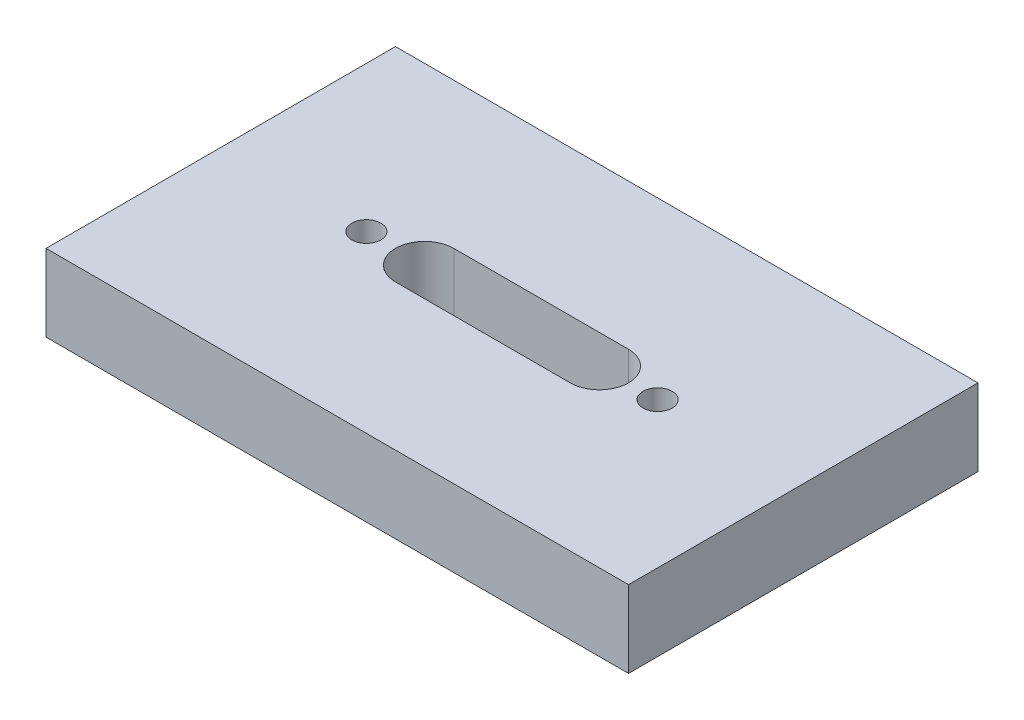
ISO-10303-21;
HEADER;
FILE_DESCRIPTION(('STEP AP214'),'2;1');
FILE_NAME('part.step','',(''),(''),'','','');
FILE_SCHEMA(('AUTOMOTIVE_DESIGN { 1 0 10303 214 1 1 1 1 }'));
ENDSEC;
DATA;
#1=APPLICATION_CONTEXT('core data for automotive mechanical design processes');
#2=APPLICATION_PROTOCOL_DEFINITION('international standard','automotive_design',2000,#1);
#3=PRODUCT_CONTEXT('',#1,'mechanical');
#4=PRODUCT('Part','Part','',(#3));
#5=PRODUCT_RELATED_PRODUCT_CATEGORY('part','',(#4));
#6=PRODUCT_DEFINITION_FORMATION('','',#4);
#7=PRODUCT_DEFINITION_CONTEXT('part definition',#1,'design');
#8=PRODUCT_DEFINITION('design','',#6,#7);
#9=PRODUCT_DEFINITION_SHAPE('','',#8);
#10=(LENGTH_UNIT() NAMED_UNIT(*) SI_UNIT(.MILLI.,.METRE.));
#11=(NAMED_UNIT(*) PLANE_ANGLE_UNIT() SI_UNIT($,.RADIAN.));
#12=(NAMED_UNIT(*) SI_UNIT($,.STERADIAN.) SOLID_ANGLE_UNIT());
#13=UNCERTAINTY_MEASURE_WITH_UNIT(LENGTH_MEASURE(1.E-05),#10,'distance_accuracy_value','');
#14=(GEOMETRIC_REPRESENTATION_CONTEXT(3) GLOBAL_UNCERTAINTY_ASSIGNED_CONTEXT((#13)) GLOBAL_UNIT_ASSIGNED_CONTEXT((#10,
#11,#12)) REPRESENTATION_CONTEXT('',''));
#15=CARTESIAN_POINT('',(0.,0.,0.));
#16=DIRECTION('',(0.,0.,1.));
#17=DIRECTION('',(1.,0.,0.));
#18=AXIS2_PLACEMENT_3D('',#15,#16,#17);
#19=CARTESIAN_POINT('',(63.5,16.764,38.1));
#20=DIRECTION('',(-1.,0.,0.));
#21=DIRECTION('',(0.,0.,1.));
#22=AXIS2_PLACEMENT_3D('',#19,#20,#21);
#23=PLANE('',#22);
#24=DIRECTION('',(0.,0.,-1.));
#25=VECTOR('',#24,1.);
#26=CARTESIAN_POINT('',(63.5,0.,38.1));
#27=LINE('',#26,#25);
#28=CARTESIAN_POINT('',(63.5,0.,38.1));
#29=VERTEX_POINT('',#28);
#30=CARTESIAN_POINT('',(63.5,0.,-38.1));
#31=VERTEX_POINT('',#30);
#32=EDGE_CURVE('E134',#29,#31,#27,.T.);
#33=ORIENTED_EDGE('',*,*,#32,.T.);
#34=DIRECTION('',(0.,-1.,0.));
#35=VECTOR('',#34,1.);
#36=CARTESIAN_POINT('',(63.5,16.764,-38.1));
#37=LINE('',#36,#35);
#38=CARTESIAN_POINT('',(63.5,16.764,-38.1));
#39=VERTEX_POINT('',#38);
#40=EDGE_CURVE('E11',#39,#31,#37,.T.);
#41=ORIENTED_EDGE('',*,*,#40,.F.);
#42=DIRECTION('',(0.,0.,-1.));
#43=VECTOR('',#42,1.);
#44=CARTESIAN_POINT('',(63.5,16.764,38.1));
#45=LINE('',#44,#43);
#46=CARTESIAN_POINT('',(63.5,16.764,38.1));
#47=VERTEX_POINT('',#46);
#48=EDGE_CURVE('E138',#47,#39,#45,.T.);
#49=ORIENTED_EDGE('',*,*,#48,.F.);
#50=DIRECTION('',(0.,-1.,0.));
#51=VECTOR('',#50,1.);
#52=CARTESIAN_POINT('',(63.5,16.764,38.1));
#53=LINE('',#52,#51);
#54=EDGE_CURVE('E148',#47,#29,#53,.T.);
#55=ORIENTED_EDGE('',*,*,#54,.T.);
#56=EDGE_LOOP('',(#33,#41,#49,#55));
#57=FACE_BOUND('',#56,.T.);
#58=ADVANCED_FACE('F33',(#57),#23,.F.);
#59=CARTESIAN_POINT('',(-63.5,16.764,-38.1));
#60=DIRECTION('',(0.,0.,1.));
#61=DIRECTION('',(1.,0.,0.));
#62=AXIS2_PLACEMENT_3D('',#59,#60,#61);
#63=PLANE('',#62);
#64=DIRECTION('',(-1.,0.,0.));
#65=VECTOR('',#64,1.);
#66=CARTESIAN_POINT('',(-63.5,0.,-38.1));
#67=LINE('',#66,#65);
#68=CARTESIAN_POINT('',(-63.5,0.,-38.1));
#69=VERTEX_POINT('',#68);
#70=EDGE_CURVE('E151',#31,#69,#67,.T.);
#71=ORIENTED_EDGE('',*,*,#70,.T.);
#72=DIRECTION('',(0.,-1.,0.));
#73=VECTOR('',#72,1.);
#74=CARTESIAN_POINT('',(-63.5,16.764,-38.1));
#75=LINE('',#74,#73);
#76=CARTESIAN_POINT('',(-63.5,16.764,-38.1));
#77=VERTEX_POINT('',#76);
#78=EDGE_CURVE('E40',#77,#69,#75,.T.);
#79=ORIENTED_EDGE('',*,*,#78,.F.);
#80=DIRECTION('',(-1.,0.,0.));
#81=VECTOR('',#80,1.);
#82=CARTESIAN_POINT('',(-63.5,16.764,-38.1));
#83=LINE('',#82,#81);
#84=EDGE_CURVE('E141',#39,#77,#83,.T.);
#85=ORIENTED_EDGE('',*,*,#84,.F.);
#86=ORIENTED_EDGE('',*,*,#40,.T.);
#87=EDGE_LOOP('',(#71,#79,#85,#86));
#88=FACE_BOUND('',#87,.T.);
#89=ADVANCED_FACE('F179',(#88),#63,.F.);
#90=CARTESIAN_POINT('',(-63.5,16.764,38.1));
#91=DIRECTION('',(1.,0.,0.));
#92=DIRECTION('',(0.,0.,-1.));
#93=AXIS2_PLACEMENT_3D('',#90,#91,#92);
#94=PLANE('',#93);
#95=DIRECTION('',(0.,0.,1.));
#96=VECTOR('',#95,1.);
#97=CARTESIAN_POINT('',(-63.5,0.,38.1));
#98=LINE('',#97,#96);
#99=CARTESIAN_POINT('',(-63.5,0.,38.1));
#100=VERTEX_POINT('',#99);
#101=EDGE_CURVE('E153',#69,#100,#98,.T.);
#102=ORIENTED_EDGE('',*,*,#101,.T.);
#103=DIRECTION('',(0.,-1.,0.));
#104=VECTOR('',#103,1.);
#105=CARTESIAN_POINT('',(-63.5,16.764,38.1));
#106=LINE('',#105,#104);
#107=CARTESIAN_POINT('',(-63.5,16.764,38.1));
#108=VERTEX_POINT('',#107);
#109=EDGE_CURVE('E158',#108,#100,#106,.T.);
#110=ORIENTED_EDGE('',*,*,#109,.F.);
#111=DIRECTION('',(0.,0.,1.));
#112=VECTOR('',#111,1.);
#113=CARTESIAN_POINT('',(-63.5,16.764,38.1));
#114=LINE('',#113,#112);
#115=EDGE_CURVE('E144',#77,#108,#114,.T.);
#116=ORIENTED_EDGE('',*,*,#115,.F.);
#117=ORIENTED_EDGE('',*,*,#78,.T.);
#118=EDGE_LOOP('',(#102,#110,#116,#117));
#119=FACE_BOUND('',#118,.T.);
#120=ADVANCED_FACE('F165',(#119),#94,.F.);
#121=CARTESIAN_POINT('',(-63.5,16.764,38.1));
#122=DIRECTION('',(0.,0.,-1.));
#123=DIRECTION('',(-1.,0.,0.));
#124=AXIS2_PLACEMENT_3D('',#121,#122,#123);
#125=PLANE('',#124);
#126=DIRECTION('',(1.,0.,0.));
#127=VECTOR('',#126,1.);
#128=CARTESIAN_POINT('',(-63.5,0.,38.1));
#129=LINE('',#128,#127);
#130=EDGE_CURVE('E142',#100,#29,#129,.T.);
#131=ORIENTED_EDGE('',*,*,#130,.T.);
#132=ORIENTED_EDGE('',*,*,#54,.F.);
#133=DIRECTION('',(1.,0.,0.));
#134=VECTOR('',#133,1.);
#135=CARTESIAN_POINT('',(-63.5,16.764,38.1));
#136=LINE('',#135,#134);
#137=EDGE_CURVE('E146',#108,#47,#136,.T.);
#138=ORIENTED_EDGE('',*,*,#137,.F.);
#139=ORIENTED_EDGE('',*,*,#109,.T.);
#140=EDGE_LOOP('',(#131,#132,#138,#139));
#141=FACE_BOUND('',#140,.T.);
#142=ADVANCED_FACE('F172',(#141),#125,.F.);
#143=CARTESIAN_POINT('',(0.,16.764,0.));
#144=DIRECTION('',(0.,-1.,0.));
#145=DIRECTION('',(0.,0.,-1.));
#146=AXIS2_PLACEMENT_3D('',#143,#144,#145);
#147=PLANE('',#146);
#148=CARTESIAN_POINT('',(-31.75,16.764,0.));
#149=DIRECTION('',(0.,1.,0.));
#150=DIRECTION('',(0.,0.,-1.));
#151=AXIS2_PLACEMENT_3D('',#148,#149,#150);
#152=CIRCLE('',#151,3.175);
#153=CARTESIAN_POINT('',(-31.75,16.764,-3.175));
#154=VERTEX_POINT('',#153);
#155=EDGE_CURVE('E221',#154,#154,#152,.T.);
#156=ORIENTED_EDGE('',*,*,#155,.F.);
#157=EDGE_LOOP('',(#156));
#158=FACE_BOUND('',#157,.T.);
#159=CARTESIAN_POINT('',(31.75,16.764,0.));
#160=DIRECTION('',(0.,1.,0.));
#161=DIRECTION('',(0.,0.,1.));
#162=AXIS2_PLACEMENT_3D('',#159,#160,#161);
#163=CIRCLE('',#162,3.175);
#164=CARTESIAN_POINT('',(31.75,16.764,3.175));
#165=VERTEX_POINT('',#164);
#166=EDGE_CURVE('E121',#165,#165,#163,.T.);
#167=ORIENTED_EDGE('',*,*,#166,.F.);
#168=EDGE_LOOP('',(#167));
#169=FACE_BOUND('',#168,.T.);
#170=DIRECTION('',(1.,0.,0.));
#171=VECTOR('',#170,1.);
#172=CARTESIAN_POINT('',(-19.05,16.764,6.35));
#173=LINE('',#172,#171);
#174=CARTESIAN_POINT('',(-19.05,16.764,6.35));
#175=VERTEX_POINT('',#174);
#176=CARTESIAN_POINT('',(19.05,16.764,6.35000000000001));
#177=VERTEX_POINT('',#176);
#178=EDGE_CURVE('E127',#175,#177,#173,.T.);
#179=ORIENTED_EDGE('',*,*,#178,.F.);
#180=CARTESIAN_POINT('',(-19.05,16.764,0.));
#181=DIRECTION('',(0.,1.,0.));
#182=DIRECTION('',(0.,0.,1.));
#183=AXIS2_PLACEMENT_3D('',#180,#181,#182);
#184=CIRCLE('',#183,6.35);
#185=CARTESIAN_POINT('',(-19.05,16.764,-6.35));
#186=VERTEX_POINT('',#185);
#187=EDGE_CURVE('E47',#186,#175,#184,.T.);
#188=ORIENTED_EDGE('',*,*,#187,.F.);
#189=DIRECTION('',(-1.,0.,0.));
#190=VECTOR('',#189,1.);
#191=CARTESIAN_POINT('',(-19.05,16.764,-6.35));
#192=LINE('',#191,#190);
#193=CARTESIAN_POINT('',(19.05,16.764,-6.35));
#194=VERTEX_POINT('',#193);
#195=EDGE_CURVE('E115',#194,#186,#192,.T.);
#196=ORIENTED_EDGE('',*,*,#195,.F.);
#197=CARTESIAN_POINT('',(19.05,16.764,0.));
#198=DIRECTION('',(0.,1.,0.));
#199=DIRECTION('',(0.,0.,1.));
#200=AXIS2_PLACEMENT_3D('',#197,#198,#199);
#201=CIRCLE('',#200,6.35);
#202=EDGE_CURVE('E118',#177,#194,#201,.T.);
#203=ORIENTED_EDGE('',*,*,#202,.F.);
#204=EDGE_LOOP('',(#179,#188,#196,#203));
#205=FACE_BOUND('',#204,.T.);
#206=ORIENTED_EDGE('',*,*,#48,.T.);
#207=ORIENTED_EDGE('',*,*,#84,.T.);
#208=ORIENTED_EDGE('',*,*,#115,.T.);
#209=ORIENTED_EDGE('',*,*,#137,.T.);
#210=EDGE_LOOP('',(#206,#207,#208,#209));
#211=FACE_BOUND('',#210,.T.);
#212=ADVANCED_FACE('F178',(#158,#169,#205,#211),#147,.F.);
#213=CARTESIAN_POINT('',(0.,0.,0.));
#214=DIRECTION('',(0.,-1.,0.));
#215=DIRECTION('',(0.,0.,-1.));
#216=AXIS2_PLACEMENT_3D('',#213,#214,#215);
#217=PLANE('',#216);
#218=CARTESIAN_POINT('',(-31.75,0.,0.));
#219=DIRECTION('',(0.,1.,0.));
#220=DIRECTION('',(0.,0.,-1.));
#221=AXIS2_PLACEMENT_3D('',#218,#219,#220);
#222=CIRCLE('',#221,3.175);
#223=CARTESIAN_POINT('',(-31.75,0.,-3.175));
#224=VERTEX_POINT('',#223);
#225=EDGE_CURVE('E218',#224,#224,#222,.T.);
#226=ORIENTED_EDGE('',*,*,#225,.T.);
#227=EDGE_LOOP('',(#226));
#228=FACE_BOUND('',#227,.T.);
#229=CARTESIAN_POINT('',(31.75,0.,0.));
#230=DIRECTION('',(0.,1.,0.));
#231=DIRECTION('',(0.,0.,1.));
#232=AXIS2_PLACEMENT_3D('',#229,#230,#231);
#233=CIRCLE('',#232,3.175);
#234=CARTESIAN_POINT('',(31.75,0.,3.175));
#235=VERTEX_POINT('',#234);
#236=EDGE_CURVE('E128',#235,#235,#233,.T.);
#237=ORIENTED_EDGE('',*,*,#236,.T.);
#238=EDGE_LOOP('',(#237));
#239=FACE_BOUND('',#238,.T.);
#240=CARTESIAN_POINT('',(-19.05,0.,0.));
#241=DIRECTION('',(0.,1.,0.));
#242=DIRECTION('',(0.,0.,1.));
#243=AXIS2_PLACEMENT_3D('',#240,#241,#242);
#244=CIRCLE('',#243,6.35);
#245=CARTESIAN_POINT('',(-19.05,0.,-6.35));
#246=VERTEX_POINT('',#245);
#247=CARTESIAN_POINT('',(-19.05,0.,6.35));
#248=VERTEX_POINT('',#247);
#249=EDGE_CURVE('E99',#246,#248,#244,.T.);
#250=ORIENTED_EDGE('',*,*,#249,.T.);
#251=DIRECTION('',(1.,0.,0.));
#252=VECTOR('',#251,1.);
#253=CARTESIAN_POINT('',(-19.05,0.,6.35));
#254=LINE('',#253,#252);
#255=CARTESIAN_POINT('',(19.05,0.,6.35));
#256=VERTEX_POINT('',#255);
#257=EDGE_CURVE('E108',#248,#256,#254,.T.);
#258=ORIENTED_EDGE('',*,*,#257,.T.);
#259=CARTESIAN_POINT('',(19.05,0.,0.));
#260=DIRECTION('',(0.,1.,0.));
#261=DIRECTION('',(0.,0.,1.));
#262=AXIS2_PLACEMENT_3D('',#259,#260,#261);
#263=CIRCLE('',#262,6.35);
#264=CARTESIAN_POINT('',(19.05,0.,-6.35));
#265=VERTEX_POINT('',#264);
#266=EDGE_CURVE('E55',#256,#265,#263,.T.);
#267=ORIENTED_EDGE('',*,*,#266,.T.);
#268=DIRECTION('',(-1.,0.,0.));
#269=VECTOR('',#268,1.);
#270=CARTESIAN_POINT('',(-19.05,0.,-6.35));
#271=LINE('',#270,#269);
#272=EDGE_CURVE('E105',#265,#246,#271,.T.);
#273=ORIENTED_EDGE('',*,*,#272,.T.);
#274=EDGE_LOOP('',(#250,#258,#267,#273));
#275=FACE_BOUND('',#274,.T.);
#276=ORIENTED_EDGE('',*,*,#32,.F.);
#277=ORIENTED_EDGE('',*,*,#130,.F.);
#278=ORIENTED_EDGE('',*,*,#101,.F.);
#279=ORIENTED_EDGE('',*,*,#70,.F.);
#280=EDGE_LOOP('',(#276,#277,#278,#279));
#281=FACE_BOUND('',#280,.T.);
#282=ADVANCED_FACE('F112',(#228,#239,#275,#281),#217,.T.);
#283=CARTESIAN_POINT('',(-19.05,0.,0.));
#284=DIRECTION('',(0.,1.,0.));
#285=DIRECTION('',(0.,0.,1.));
#286=AXIS2_PLACEMENT_3D('',#283,#284,#285);
#287=CYLINDRICAL_SURFACE('',#286,6.35);
#288=ORIENTED_EDGE('',*,*,#187,.T.);
#289=DIRECTION('',(0.,1.,0.));
#290=VECTOR('',#289,1.);
#291=CARTESIAN_POINT('',(-19.05,0.,6.35));
#292=LINE('',#291,#290);
#293=EDGE_CURVE('E95',#248,#175,#292,.T.);
#294=ORIENTED_EDGE('',*,*,#293,.F.);
#295=ORIENTED_EDGE('',*,*,#249,.F.);
#296=DIRECTION('',(0.,1.,0.));
#297=VECTOR('',#296,1.);
#298=CARTESIAN_POINT('',(-19.05,0.,-6.35));
#299=LINE('',#298,#297);
#300=EDGE_CURVE('E132',#246,#186,#299,.T.);
#301=ORIENTED_EDGE('',*,*,#300,.T.);
#302=EDGE_LOOP('',(#288,#294,#295,#301));
#303=FACE_BOUND('',#302,.T.);
#304=ADVANCED_FACE('F97',(#303),#287,.F.);
#305=CARTESIAN_POINT('',(-19.05,0.,-6.35));
#306=DIRECTION('',(0.,0.,-1.));
#307=DIRECTION('',(-1.,0.,0.));
#308=AXIS2_PLACEMENT_3D('',#305,#306,#307);
#309=PLANE('',#308);
#310=ORIENTED_EDGE('',*,*,#195,.T.);
#311=ORIENTED_EDGE('',*,*,#300,.F.);
#312=ORIENTED_EDGE('',*,*,#272,.F.);
#313=DIRECTION('',(0.,1.,0.));
#314=VECTOR('',#313,1.);
#315=CARTESIAN_POINT('',(19.05,0.,-6.35));
#316=LINE('',#315,#314);
#317=EDGE_CURVE('E135',#265,#194,#316,.T.);
#318=ORIENTED_EDGE('',*,*,#317,.T.);
#319=EDGE_LOOP('',(#310,#311,#312,#318));
#320=FACE_BOUND('',#319,.T.);
#321=ADVANCED_FACE('F197',(#320),#309,.F.);
#322=CARTESIAN_POINT('',(19.05,0.,0.));
#323=DIRECTION('',(0.,1.,0.));
#324=DIRECTION('',(0.,0.,1.));
#325=AXIS2_PLACEMENT_3D('',#322,#323,#324);
#326=CYLINDRICAL_SURFACE('',#325,6.35);
#327=ORIENTED_EDGE('',*,*,#202,.T.);
#328=ORIENTED_EDGE('',*,*,#317,.F.);
#329=ORIENTED_EDGE('',*,*,#266,.F.);
#330=DIRECTION('',(0.,1.,0.));
#331=VECTOR('',#330,1.);
#332=CARTESIAN_POINT('',(19.05,0.,6.35000000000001));
#333=LINE('',#332,#331);
#334=EDGE_CURVE('E104',#256,#177,#333,.T.);
#335=ORIENTED_EDGE('',*,*,#334,.T.);
#336=EDGE_LOOP('',(#327,#328,#329,#335));
#337=FACE_BOUND('',#336,.T.);
#338=ADVANCED_FACE('F201',(#337),#326,.F.);
#339=CARTESIAN_POINT('',(-19.05,0.,6.35));
#340=DIRECTION('',(0.,0.,1.));
#341=DIRECTION('',(1.,0.,0.));
#342=AXIS2_PLACEMENT_3D('',#339,#340,#341);
#343=PLANE('',#342);
#344=ORIENTED_EDGE('',*,*,#178,.T.);
#345=ORIENTED_EDGE('',*,*,#334,.F.);
#346=ORIENTED_EDGE('',*,*,#257,.F.);
#347=ORIENTED_EDGE('',*,*,#293,.T.);
#348=EDGE_LOOP('',(#344,#345,#346,#347));
#349=FACE_BOUND('',#348,.T.);
#350=ADVANCED_FACE('F109',(#349),#343,.F.);
#351=CARTESIAN_POINT('',(31.75,0.,0.));
#352=DIRECTION('',(0.,1.,0.));
#353=DIRECTION('',(0.,0.,1.));
#354=AXIS2_PLACEMENT_3D('',#351,#352,#353);
#355=CYLINDRICAL_SURFACE('',#354,3.175);
#356=ORIENTED_EDGE('',*,*,#236,.F.);
#357=EDGE_LOOP('',(#356));
#358=FACE_BOUND('',#357,.T.);
#359=ORIENTED_EDGE('',*,*,#166,.T.);
#360=EDGE_LOOP('',(#359));
#361=FACE_BOUND('',#360,.T.);
#362=ADVANCED_FACE('F200',(#358,#361),#355,.F.);
#363=CARTESIAN_POINT('',(-31.75,0.,0.));
#364=DIRECTION('',(0.,1.,0.));
#365=DIRECTION('',(0.,0.,1.));
#366=AXIS2_PLACEMENT_3D('',#363,#364,#365);
#367=CYLINDRICAL_SURFACE('',#366,3.175);
#368=ORIENTED_EDGE('',*,*,#225,.F.);
#369=EDGE_LOOP('',(#368));
#370=FACE_BOUND('',#369,.T.);
#371=ORIENTED_EDGE('',*,*,#155,.T.);
#372=EDGE_LOOP('',(#371));
#373=FACE_BOUND('',#372,.T.);
#374=ADVANCED_FACE('F209',(#370,#373),#367,.F.);
#375=CLOSED_SHELL('',(#58,#89,#120,#142,#212,#282,#304,#321,#338,#350,#362,#374));
#376=MANIFOLD_SOLID_BREP('B2',#375);
#377=ADVANCED_BREP_SHAPE_REPRESENTATION('',(#18,#376),#14);
#378=SHAPE_DEFINITION_REPRESENTATION(#9,#377);
ENDSEC;
END-ISO-10303-21;
